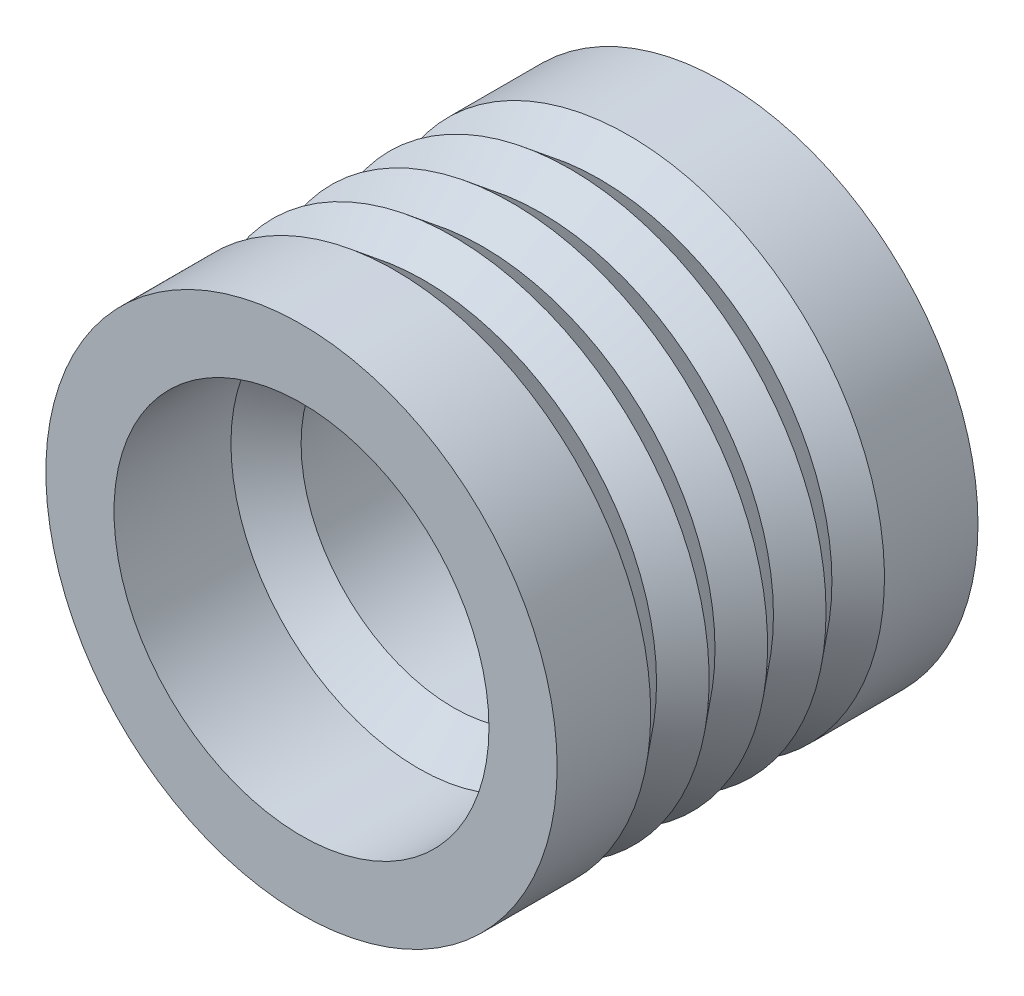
ISO-10303-21;
HEADER;
FILE_DESCRIPTION(('STEP AP214'),'2;1');
FILE_NAME('part.step','',(''),(''),'','','');
FILE_SCHEMA(('AUTOMOTIVE_DESIGN { 1 0 10303 214 1 1 1 1 }'));
ENDSEC;
DATA;
#1=APPLICATION_CONTEXT('core data for automotive mechanical design processes');
#2=APPLICATION_PROTOCOL_DEFINITION('international standard','automotive_design',2000,#1);
#3=PRODUCT_CONTEXT('',#1,'mechanical');
#4=PRODUCT('Part','Part','',(#3));
#5=PRODUCT_RELATED_PRODUCT_CATEGORY('part','',(#4));
#6=PRODUCT_DEFINITION_FORMATION('','',#4);
#7=PRODUCT_DEFINITION_CONTEXT('part definition',#1,'design');
#8=PRODUCT_DEFINITION('design','',#6,#7);
#9=PRODUCT_DEFINITION_SHAPE('','',#8);
#10=(LENGTH_UNIT() NAMED_UNIT(*) SI_UNIT(.MILLI.,.METRE.));
#11=(NAMED_UNIT(*) PLANE_ANGLE_UNIT() SI_UNIT($,.RADIAN.));
#12=(NAMED_UNIT(*) SI_UNIT($,.STERADIAN.) SOLID_ANGLE_UNIT());
#13=UNCERTAINTY_MEASURE_WITH_UNIT(LENGTH_MEASURE(1.E-05),#10,'distance_accuracy_value','');
#14=(GEOMETRIC_REPRESENTATION_CONTEXT(3) GLOBAL_UNCERTAINTY_ASSIGNED_CONTEXT((#13)) GLOBAL_UNIT_ASSIGNED_CONTEXT((#10,
#11,#12)) REPRESENTATION_CONTEXT('',''));
#15=CARTESIAN_POINT('',(0.,0.,0.));
#16=DIRECTION('',(0.,0.,1.));
#17=DIRECTION('',(1.,0.,0.));
#18=AXIS2_PLACEMENT_3D('',#15,#16,#17);
#19=CARTESIAN_POINT('',(2.25031712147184E-05,-7.34145371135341E-07,3.43750082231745));
#20=DIRECTION('',(1.88332307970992E-07,-1.03073929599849E-12,-0.999999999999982));
#21=DIRECTION('',(-0.999999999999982,0.,-1.88332307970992E-07));
#22=AXIS2_PLACEMENT_3D('',#19,#20,#21);
#23=CONICAL_SURFACE('',#22,15.0370018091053,0.674740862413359);
#24=CARTESIAN_POINT('',(2.25031664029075E-05,-7.34158173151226E-07,3.43791386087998));
#25=DIRECTION('',(-1.88339882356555E-07,-1.80623636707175E-13,-0.999999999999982));
#26=DIRECTION('',(-0.999999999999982,1.24911532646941E-13,1.88339882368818E-07));
#27=AXIS2_PLACEMENT_3D('',#24,#25,#26);
#28=CIRCLE('',#27,15.0373276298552);
#29=CARTESIAN_POINT('',(-15.0373051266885,-7.34156294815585E-07,3.4379166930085));
#30=VERTEX_POINT('',#29);
#31=EDGE_CURVE('E77',#30,#30,#28,.T.);
#32=ORIENTED_EDGE('',*,*,#31,.F.);
#33=EDGE_LOOP('',(#32));
#34=FACE_BOUND('',#33,.T.);
#35=CARTESIAN_POINT('',(2.21793734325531E-05,-7.3414795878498E-07,5.15667397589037));
#36=DIRECTION('',(1.88346803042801E-07,-6.78246413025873E-13,0.999999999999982));
#37=DIRECTION('',(0.999999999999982,0.,-1.88346803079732E-07));
#38=AXIS2_PLACEMENT_3D('',#35,#36,#37);
#39=CIRCLE('',#38,13.6623362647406);
#40=CARTESIAN_POINT('',(13.6623584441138,-7.3414795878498E-07,5.15667140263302));
#41=VERTEX_POINT('',#40);
#42=EDGE_CURVE('E332',#41,#41,#39,.T.);
#43=ORIENTED_EDGE('',*,*,#42,.F.);
#44=EDGE_LOOP('',(#43));
#45=FACE_BOUND('',#44,.T.);
#46=ADVANCED_FACE('F62',(#34,#45),#23,.T.);
#47=CARTESIAN_POINT('',(2.25030825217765E-05,-7.34156937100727E-07,9.48353091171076E-07));
#48=DIRECTION('',(1.88340592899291E-07,0.,-0.999999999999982));
#49=DIRECTION('',(-0.999999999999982,0.,-1.88340592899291E-07));
#50=AXIS2_PLACEMENT_3D('',#47,#48,#49);
#51=CONICAL_SURFACE('',#50,15.0370018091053,0.67474086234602);
#52=CARTESIAN_POINT('',(2.25031708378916E-05,-7.34154755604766E-07,0.00041393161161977));
#53=DIRECTION('',(-1.88339512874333E-07,1.27272012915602E-13,-0.999999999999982));
#54=DIRECTION('',(-0.999999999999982,-1.02462142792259E-13,1.88339512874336E-07));
#55=AXIS2_PLACEMENT_3D('',#52,#53,#54);
#56=CIRCLE('',#55,15.0373276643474);
#57=CARTESIAN_POINT('',(-15.0373051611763,-7.3415629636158E-07,0.000416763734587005));
#58=VERTEX_POINT('',#57);
#59=EDGE_CURVE('E82',#58,#58,#56,.T.);
#60=ORIENTED_EDGE('',*,*,#59,.F.);
#61=EDGE_LOOP('',(#60));
#62=FACE_BOUND('',#61,.T.);
#63=CARTESIAN_POINT('',(2.21794591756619E-05,-7.34158483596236E-07,1.71917419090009));
#64=DIRECTION('',(1.88339882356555E-07,1.80623636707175E-13,0.999999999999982));
#65=DIRECTION('',(0.999999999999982,0.,-1.88339882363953E-07));
#66=AXIS2_PLACEMENT_3D('',#63,#64,#65);
#67=CIRCLE('',#66,13.6623361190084);
#68=CARTESIAN_POINT('',(13.6623582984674,-7.34158483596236E-07,1.71917161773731));
#69=VERTEX_POINT('',#68);
#70=EDGE_CURVE('E590',#69,#69,#67,.T.);
#71=ORIENTED_EDGE('',*,*,#70,.F.);
#72=EDGE_LOOP('',(#71));
#73=FACE_BOUND('',#72,.T.);
#74=ADVANCED_FACE('F395',(#62,#73),#51,.T.);
#75=CARTESIAN_POINT('',(2.25030669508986E-05,-7.34150887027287E-07,-3.43749902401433));
#76=DIRECTION('',(1.88342056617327E-07,-4.95743691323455E-13,-0.999999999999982));
#77=DIRECTION('',(-0.999999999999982,0.,-1.88342056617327E-07));
#78=AXIS2_PLACEMENT_3D('',#75,#76,#77);
#79=CONICAL_SURFACE('',#78,15.0370018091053,0.674740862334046);
#80=CARTESIAN_POINT('',(2.25031812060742E-05,-7.34151596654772E-07,-3.43708600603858));
#81=DIRECTION('',(-1.88338518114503E-07,4.64679130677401E-13,-0.999999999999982));
#82=DIRECTION('',(-0.999999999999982,-3.12516339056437E-13,1.88338518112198E-07));
#83=AXIS2_PLACEMENT_3D('',#80,#81,#82);
#84=CIRCLE('',#83,15.0373276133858);
#85=CARTESIAN_POINT('',(-15.0373051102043,-7.34156296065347E-07,-3.43708317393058));
#86=VERTEX_POINT('',#85);
#87=EDGE_CURVE('E94',#86,#86,#84,.T.);
#88=ORIENTED_EDGE('',*,*,#87,.F.);
#89=EDGE_LOOP('',(#88));
#90=FACE_BOUND('',#89,.T.);
#91=CARTESIAN_POINT('',(2.21794642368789E-05,-7.34154536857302E-07,-1.71832578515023));
#92=DIRECTION('',(1.88339512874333E-07,-1.27272012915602E-13,0.999999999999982));
#93=DIRECTION('',(0.999999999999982,0.,-1.88339512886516E-07));
#94=AXIS2_PLACEMENT_3D('',#91,#92,#93);
#95=CIRCLE('',#94,13.6623361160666);
#96=CARTESIAN_POINT('',(13.6623582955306,-7.34154536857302E-07,-1.71832835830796));
#97=VERTEX_POINT('',#96);
#98=EDGE_CURVE('E278',#97,#97,#95,.T.);
#99=ORIENTED_EDGE('',*,*,#98,.F.);
#100=EDGE_LOOP('',(#99));
#101=FACE_BOUND('',#100,.T.);
#102=ADVANCED_FACE('F357',(#90,#101),#79,.T.);
#103=CARTESIAN_POINT('',(2.45472467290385E-05,-7.34156309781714E-07,12.3750032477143));
#104=DIRECTION('',(0.,0.,-1.));
#105=DIRECTION('',(0.,1.,0.));
#106=AXIS2_PLACEMENT_3D('',#103,#104,#105);
#107=CYLINDRICAL_SURFACE('',#106,11.0249302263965);
#108=CARTESIAN_POINT('',(2.45472404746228E-05,-7.34162192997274E-07,5.49807641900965));
#109=DIRECTION('',(6.94210531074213E-13,6.54043984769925E-13,1.));
#110=DIRECTION('',(-0.997203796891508,-0.0747300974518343,7.41132982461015E-13));
#111=AXIS2_PLACEMENT_3D('',#108,#109,#110);
#112=CIRCLE('',#111,11.0255718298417);
#113=CARTESIAN_POINT('',(-10.9947175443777,-0.823942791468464,5.49807641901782));
#114=VERTEX_POINT('',#113);
#115=EDGE_CURVE('E12',#114,#114,#112,.T.);
#116=ORIENTED_EDGE('',*,*,#115,.F.);
#117=EDGE_LOOP('',(#116));
#118=FACE_BOUND('',#117,.T.);
#119=CARTESIAN_POINT('',(2.45472467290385E-05,-7.34156309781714E-07,12.3750032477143));
#120=DIRECTION('',(0.,0.,1.));
#121=DIRECTION('',(1.,0.,0.));
#122=AXIS2_PLACEMENT_3D('',#119,#120,#121);
#123=CIRCLE('',#122,11.0249302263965);
#124=CARTESIAN_POINT('',(11.0249547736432,-7.34156309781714E-07,12.3750032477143));
#125=VERTEX_POINT('',#124);
#126=EDGE_CURVE('E84',#125,#125,#123,.F.);
#127=ORIENTED_EDGE('',*,*,#126,.F.);
#128=EDGE_LOOP('',(#127));
#129=FACE_BOUND('',#128,.T.);
#130=ADVANCED_FACE('F162',(#118,#129),#107,.F.);
#131=CARTESIAN_POINT('',(2.45472404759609E-05,-7.34162191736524E-07,5.50000404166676));
#132=DIRECTION('',(6.94210531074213E-13,6.54043984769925E-13,1.));
#133=DIRECTION('',(1.,0.,-6.94210531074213E-13));
#134=AXIS2_PLACEMENT_3D('',#131,#132,#133);
#135=CONICAL_SURFACE('',#134,11.027499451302,0.785397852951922);
#136=CARTESIAN_POINT('',(2.45472470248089E-05,-7.34156303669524E-07,3.4355889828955));
#137=DIRECTION('',(0.,0.,1.));
#138=DIRECTION('',(-1.,0.,0.));
#139=AXIS2_PLACEMENT_3D('',#136,#137,#138);
#140=CIRCLE('',#139,8.96244795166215);
#141=CARTESIAN_POINT('',(-8.96242340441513,-7.34156302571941E-07,3.4355889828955));
#142=VERTEX_POINT('',#141);
#143=EDGE_CURVE('E89',#142,#142,#140,.T.);
#144=ORIENTED_EDGE('',*,*,#143,.F.);
#145=EDGE_LOOP('',(#144));
#146=FACE_BOUND('',#145,.T.);
#147=ORIENTED_EDGE('',*,*,#115,.T.);
#148=EDGE_LOOP('',(#147));
#149=FACE_BOUND('',#148,.T.);
#150=ADVANCED_FACE('F160',(#146,#149),#135,.F.);
#151=CARTESIAN_POINT('',(2.45472473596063E-05,-7.34155683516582E-07,-12.3749956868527));
#152=DIRECTION('',(0.,0.,1.));
#153=DIRECTION('',(0.,-1.,0.));
#154=AXIS2_PLACEMENT_3D('',#151,#152,#153);
#155=CYLINDRICAL_SURFACE('',#154,11.0249302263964);
#156=CARTESIAN_POINT('',(2.45472461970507E-05,-7.34164014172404E-07,-5.49806885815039));
#157=DIRECTION('',(0.,8.16561933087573E-13,-1.));
#158=DIRECTION('',(-1.,6.98812719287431E-13,0.));
#159=AXIS2_PLACEMENT_3D('',#156,#157,#158);
#160=CIRCLE('',#159,11.0255718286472);
#161=CARTESIAN_POINT('',(-11.025547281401,-7.34156309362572E-07,-5.49806885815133));
#162=VERTEX_POINT('',#161);
#163=EDGE_CURVE('E176',#162,#162,#160,.T.);
#164=ORIENTED_EDGE('',*,*,#163,.F.);
#165=EDGE_LOOP('',(#164));
#166=FACE_BOUND('',#165,.T.);
#167=CARTESIAN_POINT('',(2.45472473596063E-05,-7.34155683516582E-07,-12.3749956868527));
#168=DIRECTION('',(0.,0.,1.));
#169=DIRECTION('',(1.,0.,0.));
#170=AXIS2_PLACEMENT_3D('',#167,#168,#169);
#171=CIRCLE('',#170,11.0249302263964);
#172=CARTESIAN_POINT('',(11.0249547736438,-7.34155683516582E-07,-12.3749956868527));
#173=VERTEX_POINT('',#172);
#174=EDGE_CURVE('E71',#173,#173,#171,.F.);
#175=ORIENTED_EDGE('',*,*,#174,.T.);
#176=EDGE_LOOP('',(#175));
#177=FACE_BOUND('',#176,.T.);
#178=ADVANCED_FACE('F155',(#166,#177),#155,.F.);
#179=CARTESIAN_POINT('',(2.45472468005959E-05,-7.34156304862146E-07,6.87500362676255));
#180=DIRECTION('',(2.12907409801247E-13,-1.14930376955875E-13,1.));
#181=DIRECTION('',(1.,0.,-2.12907409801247E-13));
#182=AXIS2_PLACEMENT_3D('',#179,#180,#181);
#183=CYLINDRICAL_SURFACE('',#182,15.0344251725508);
#184=CARTESIAN_POINT('',(2.25026604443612E-05,-7.34149122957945E-07,6.87311941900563));
#185=DIRECTION('',(-1.88346803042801E-07,6.78246413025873E-13,-0.999999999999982));
#186=DIRECTION('',(0.999999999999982,-4.7719674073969E-13,-1.88346803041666E-07));
#187=AXIS2_PLACEMENT_3D('',#184,#185,#186);
#188=CIRCLE('',#187,15.0354923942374);
#189=CARTESIAN_POINT('',(15.0355148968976,-7.34156297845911E-07,6.8731165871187));
#190=VERTEX_POINT('',#189);
#191=EDGE_CURVE('E344',#190,#190,#188,.T.);
#192=ORIENTED_EDGE('',*,*,#191,.F.);
#193=EDGE_LOOP('',(#192));
#194=FACE_BOUND('',#193,.T.);
#195=CARTESIAN_POINT('',(2.45472479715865E-05,-7.34156936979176E-07,12.3750032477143));
#196=DIRECTION('',(0.,0.,1.));
#197=DIRECTION('',(1.,0.,0.));
#198=AXIS2_PLACEMENT_3D('',#195,#196,#197);
#199=CIRCLE('',#198,15.0344251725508);
#200=CARTESIAN_POINT('',(15.0344497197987,-7.34156936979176E-07,12.3750032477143));
#201=VERTEX_POINT('',#200);
#202=EDGE_CURVE('E90',#201,#201,#199,.F.);
#203=ORIENTED_EDGE('',*,*,#202,.T.);
#204=EDGE_LOOP('',(#203));
#205=FACE_BOUND('',#204,.T.);
#206=ADVANCED_FACE('F146',(#194,#205),#183,.T.);
#207=CARTESIAN_POINT('',(2.45472465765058E-05,-7.34158253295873E-07,-12.3749956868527));
#208=DIRECTION('',(0.,3.4837890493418E-13,1.));
#209=DIRECTION('',(0.,-1.,3.4837890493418E-13));
#210=AXIS2_PLACEMENT_3D('',#207,#208,#209);
#211=CYLINDRICAL_SURFACE('',#210,15.0344251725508);
#212=CARTESIAN_POINT('',(2.25028235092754E-05,-7.34145418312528E-07,-6.87311185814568));
#213=DIRECTION('',(-1.88331611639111E-07,1.01610766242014E-12,0.999999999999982));
#214=DIRECTION('',(-0.997945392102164,-0.0640702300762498,-1.87944598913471E-07));
#215=AXIS2_PLACEMENT_3D('',#212,#213,#214);
#216=CIRCLE('',#215,15.0354923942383);
#217=CARTESIAN_POINT('',(-15.0045778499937,-0.963328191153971,-6.87311468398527));
#218=VERTEX_POINT('',#217);
#219=EDGE_CURVE('E140',#218,#218,#216,.T.);
#220=ORIENTED_EDGE('',*,*,#219,.F.);
#221=EDGE_LOOP('',(#220));
#222=FACE_BOUND('',#221,.T.);
#223=CARTESIAN_POINT('',(2.45472465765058E-05,-7.34158253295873E-07,-12.3749956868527));
#224=DIRECTION('',(0.,0.,1.));
#225=DIRECTION('',(1.,0.,0.));
#226=AXIS2_PLACEMENT_3D('',#223,#224,#225);
#227=CIRCLE('',#226,15.0344251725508);
#228=CARTESIAN_POINT('',(15.0344497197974,-7.34158253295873E-07,-12.3749956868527));
#229=VERTEX_POINT('',#228);
#230=EDGE_CURVE('E66',#229,#229,#227,.T.);
#231=ORIENTED_EDGE('',*,*,#230,.T.);
#232=EDGE_LOOP('',(#231));
#233=FACE_BOUND('',#232,.T.);
#234=ADVANCED_FACE('F112',(#222,#233),#211,.T.);
#235=CARTESIAN_POINT('',(2.25030158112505E-05,-7.34149124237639E-07,6.87500618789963));
#236=DIRECTION('',(1.88346803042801E-07,-6.78246413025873E-13,0.999999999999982));
#237=DIRECTION('',(0.999999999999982,0.,-1.88346803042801E-07));
#238=AXIS2_PLACEMENT_3D('',#235,#236,#237);
#239=CONICAL_SURFACE('',#238,15.0370018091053,0.674740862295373);
#240=ORIENTED_EDGE('',*,*,#191,.T.);
#241=EDGE_LOOP('',(#240));
#242=FACE_BOUND('',#241,.T.);
#243=ORIENTED_EDGE('',*,*,#42,.T.);
#244=EDGE_LOOP('',(#243));
#245=FACE_BOUND('',#244,.T.);
#246=ADVANCED_FACE('F305',(#242,#245),#239,.T.);
#247=CARTESIAN_POINT('',(2.25030896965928E-05,-7.3415817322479E-07,3.43750658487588));
#248=DIRECTION('',(1.88339882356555E-07,1.80623636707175E-13,0.999999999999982));
#249=DIRECTION('',(0.999999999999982,0.,-1.88339882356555E-07));
#250=AXIS2_PLACEMENT_3D('',#247,#248,#249);
#251=CONICAL_SURFACE('',#250,15.0370018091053,0.674740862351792);
#252=ORIENTED_EDGE('',*,*,#31,.T.);
#253=EDGE_LOOP('',(#252));
#254=FACE_BOUND('',#253,.T.);
#255=ORIENTED_EDGE('',*,*,#70,.T.);
#256=EDGE_LOOP('',(#255));
#257=FACE_BOUND('',#256,.T.);
#258=ADVANCED_FACE('F296',(#254,#257),#251,.T.);
#259=CARTESIAN_POINT('',(2.25030941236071E-05,-7.34154755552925E-07,6.61249227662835E-06));
#260=DIRECTION('',(1.88339512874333E-07,-1.27272012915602E-13,0.999999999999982));
#261=DIRECTION('',(0.999999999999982,0.,-1.88339512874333E-07));
#262=AXIS2_PLACEMENT_3D('',#259,#260,#261);
#263=CONICAL_SURFACE('',#262,15.0370018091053,0.674740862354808);
#264=ORIENTED_EDGE('',*,*,#59,.T.);
#265=EDGE_LOOP('',(#264));
#266=FACE_BOUND('',#265,.T.);
#267=ORIENTED_EDGE('',*,*,#98,.T.);
#268=EDGE_LOOP('',(#267));
#269=FACE_BOUND('',#268,.T.);
#270=ADVANCED_FACE('F250',(#266,#269),#263,.T.);
#271=CARTESIAN_POINT('',(2.25031045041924E-05,-7.34151596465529E-07,-3.4374932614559));
#272=DIRECTION('',(1.88338518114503E-07,-4.64679130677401E-13,0.999999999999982));
#273=DIRECTION('',(0.999999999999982,0.,-1.88338518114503E-07));
#274=AXIS2_PLACEMENT_3D('',#271,#272,#273);
#275=CONICAL_SURFACE('',#274,15.0370018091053,0.674740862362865);
#276=ORIENTED_EDGE('',*,*,#87,.T.);
#277=EDGE_LOOP('',(#276));
#278=FACE_BOUND('',#277,.T.);
#279=CARTESIAN_POINT('',(2.21790391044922E-05,-7.34150796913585E-07,-5.15814712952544));
#280=DIRECTION('',(1.88338518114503E-07,-4.64679130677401E-13,0.999999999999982));
#281=DIRECTION('',(0.999999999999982,-4.03477931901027E-13,-1.88338518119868E-07));
#282=AXIS2_PLACEMENT_3D('',#279,#280,#281);
#283=CIRCLE('',#282,13.6604789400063);
#284=CARTESIAN_POINT('',(13.6605011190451,-7.34156308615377E-07,-5.1581497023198));
#285=VERTEX_POINT('',#284);
#286=EDGE_CURVE('E88',#285,#285,#283,.T.);
#287=ORIENTED_EDGE('',*,*,#286,.T.);
#288=EDGE_LOOP('',(#287));
#289=FACE_BOUND('',#288,.T.);
#290=ADVANCED_FACE('F241',(#278,#289),#275,.T.);
#291=CARTESIAN_POINT('',(2.45472469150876E-05,-7.34156300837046E-07,12.3750032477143));
#292=DIRECTION('',(0.,0.,1.));
#293=DIRECTION('',(1.,0.,0.));
#294=AXIS2_PLACEMENT_3D('',#291,#292,#293);
#295=PLANE('',#294);
#296=ORIENTED_EDGE('',*,*,#202,.F.);
#297=EDGE_LOOP('',(#296));
#298=FACE_BOUND('',#297,.T.);
#299=ORIENTED_EDGE('',*,*,#126,.T.);
#300=EDGE_LOOP('',(#299));
#301=FACE_BOUND('',#300,.T.);
#302=ADVANCED_FACE('F115',(#298,#301),#295,.T.);
#303=CARTESIAN_POINT('',(2.45472461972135E-05,-7.3416401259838E-07,-5.49999648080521));
#304=DIRECTION('',(0.,8.16561933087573E-13,-1.));
#305=DIRECTION('',(0.,1.,8.16561933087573E-13));
#306=AXIS2_PLACEMENT_3D('',#303,#304,#305);
#307=CONICAL_SURFACE('',#306,11.027499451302,0.785398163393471);
#308=CARTESIAN_POINT('',(2.45472470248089E-05,-7.34156303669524E-07,-3.43558206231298));
#309=DIRECTION('',(0.,0.,-1.));
#310=DIRECTION('',(-1.,0.,0.));
#311=AXIS2_PLACEMENT_3D('',#308,#309,#310);
#312=CIRCLE('',#311,8.96244795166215);
#313=CARTESIAN_POINT('',(-8.96242340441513,-7.34156302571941E-07,-3.43558206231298));
#314=VERTEX_POINT('',#313);
#315=EDGE_CURVE('E236',#314,#314,#312,.T.);
#316=ORIENTED_EDGE('',*,*,#315,.F.);
#317=EDGE_LOOP('',(#316));
#318=FACE_BOUND('',#317,.T.);
#319=ORIENTED_EDGE('',*,*,#163,.T.);
#320=EDGE_LOOP('',(#319));
#321=FACE_BOUND('',#320,.T.);
#322=ADVANCED_FACE('F199',(#318,#321),#307,.F.);
#323=CARTESIAN_POINT('',(2.25031788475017E-05,-7.34145420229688E-07,-6.87499862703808));
#324=DIRECTION('',(1.88331611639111E-07,-1.01610766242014E-12,-0.999999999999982));
#325=DIRECTION('',(-0.999999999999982,0.,-1.88331611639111E-07));
#326=AXIS2_PLACEMENT_3D('',#323,#324,#325);
#327=CONICAL_SURFACE('',#326,15.0370018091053,0.674740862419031);
#328=ORIENTED_EDGE('',*,*,#286,.F.);
#329=EDGE_LOOP('',(#328));
#330=FACE_BOUND('',#329,.T.);
#331=ORIENTED_EDGE('',*,*,#219,.T.);
#332=EDGE_LOOP('',(#331));
#333=FACE_BOUND('',#332,.T.);
#334=ADVANCED_FACE('F110',(#330,#333),#327,.T.);
#335=CARTESIAN_POINT('',(2.45472470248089E-05,-7.34156303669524E-07,-3.43749614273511));
#336=DIRECTION('',(0.,0.,1.));
#337=DIRECTION('',(1.,0.,0.));
#338=AXIS2_PLACEMENT_3D('',#335,#336,#337);
#339=CYLINDRICAL_SURFACE('',#338,8.96244795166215);
#340=ORIENTED_EDGE('',*,*,#143,.T.);
#341=EDGE_LOOP('',(#340));
#342=FACE_BOUND('',#341,.T.);
#343=ORIENTED_EDGE('',*,*,#315,.T.);
#344=EDGE_LOOP('',(#343));
#345=FACE_BOUND('',#344,.T.);
#346=ADVANCED_FACE('F101',(#342,#345),#339,.F.);
#347=CARTESIAN_POINT('',(2.45472469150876E-05,-7.34156300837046E-07,-12.3749956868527));
#348=DIRECTION('',(0.,0.,1.));
#349=DIRECTION('',(1.,0.,0.));
#350=AXIS2_PLACEMENT_3D('',#347,#348,#349);
#351=PLANE('',#350);
#352=ORIENTED_EDGE('',*,*,#174,.F.);
#353=EDGE_LOOP('',(#352));
#354=FACE_BOUND('',#353,.T.);
#355=ORIENTED_EDGE('',*,*,#230,.F.);
#356=EDGE_LOOP('',(#355));
#357=FACE_BOUND('',#356,.T.);
#358=ADVANCED_FACE('F64',(#354,#357),#351,.F.);
#359=CLOSED_SHELL('',(#46,#74,#102,#130,#150,#178,#206,#234,#246,#258,#270,#290,#302,#322,#334,
#346,#358));
#360=MANIFOLD_SOLID_BREP('B2',#359);
#361=ADVANCED_BREP_SHAPE_REPRESENTATION('',(#18,#360),#14);
#362=SHAPE_DEFINITION_REPRESENTATION(#9,#361);
ENDSEC;
END-ISO-10303-21;
